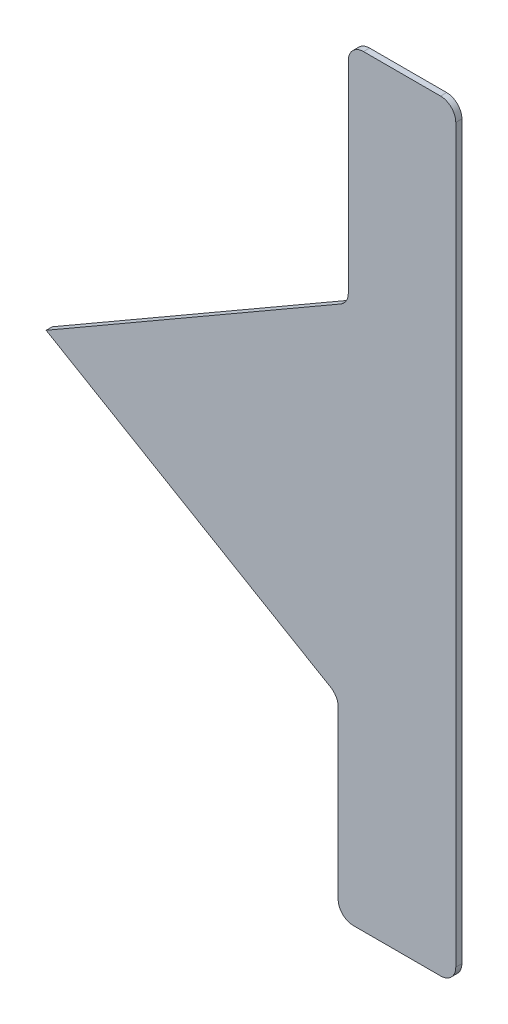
ISO-10303-21;
HEADER;
FILE_DESCRIPTION(('STEP AP214'),'2;1');
FILE_NAME('part.step','',(''),(''),'','','');
FILE_SCHEMA(('AUTOMOTIVE_DESIGN { 1 0 10303 214 1 1 1 1 }'));
ENDSEC;
DATA;
#1=APPLICATION_CONTEXT('core data for automotive mechanical design processes');
#2=APPLICATION_PROTOCOL_DEFINITION('international standard','automotive_design',2000,#1);
#3=PRODUCT_CONTEXT('',#1,'mechanical');
#4=PRODUCT('Part','Part','',(#3));
#5=PRODUCT_RELATED_PRODUCT_CATEGORY('part','',(#4));
#6=PRODUCT_DEFINITION_FORMATION('','',#4);
#7=PRODUCT_DEFINITION_CONTEXT('part definition',#1,'design');
#8=PRODUCT_DEFINITION('design','',#6,#7);
#9=PRODUCT_DEFINITION_SHAPE('','',#8);
#10=(LENGTH_UNIT() NAMED_UNIT(*) SI_UNIT(.MILLI.,.METRE.));
#11=(NAMED_UNIT(*) PLANE_ANGLE_UNIT() SI_UNIT($,.RADIAN.));
#12=(NAMED_UNIT(*) SI_UNIT($,.STERADIAN.) SOLID_ANGLE_UNIT());
#13=UNCERTAINTY_MEASURE_WITH_UNIT(LENGTH_MEASURE(1.E-05),#10,'distance_accuracy_value','');
#14=(GEOMETRIC_REPRESENTATION_CONTEXT(3) GLOBAL_UNCERTAINTY_ASSIGNED_CONTEXT((#13)) GLOBAL_UNIT_ASSIGNED_CONTEXT((#10,
#11,#12)) REPRESENTATION_CONTEXT('',''));
#15=CARTESIAN_POINT('',(0.,0.,0.));
#16=DIRECTION('',(0.,0.,1.));
#17=DIRECTION('',(1.,0.,0.));
#18=AXIS2_PLACEMENT_3D('',#15,#16,#17);
#19=CARTESIAN_POINT('',(0.,0.,-0.8));
#20=DIRECTION('',(0.,0.,1.));
#21=DIRECTION('',(1.,0.,0.));
#22=AXIS2_PLACEMENT_3D('',#19,#20,#21);
#23=PLANE('',#22);
#24=CARTESIAN_POINT('',(-2.79999999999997,2.,-0.8));
#25=DIRECTION('',(0.,0.,1.));
#26=DIRECTION('',(1.,0.,0.));
#27=AXIS2_PLACEMENT_3D('',#24,#25,#26);
#28=CIRCLE('',#27,2.);
#29=CARTESIAN_POINT('',(-2.79999999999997,0.,-0.8));
#30=VERTEX_POINT('',#29);
#31=CARTESIAN_POINT('',(-0.799999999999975,2.,-0.8));
#32=VERTEX_POINT('',#31);
#33=EDGE_CURVE('E20',#30,#32,#28,.T.);
#34=ORIENTED_EDGE('',*,*,#33,.F.);
#35=DIRECTION('',(1.,0.,0.));
#36=VECTOR('',#35,1.);
#37=CARTESIAN_POINT('',(-16.2342729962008,0.,-0.8));
#38=LINE('',#37,#36);
#39=CARTESIAN_POINT('',(-14.2342729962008,0.,-0.8));
#40=VERTEX_POINT('',#39);
#41=EDGE_CURVE('E117',#40,#30,#38,.T.);
#42=ORIENTED_EDGE('',*,*,#41,.F.);
#43=CARTESIAN_POINT('',(-14.2342729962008,2.,-0.8));
#44=DIRECTION('',(0.,0.,1.));
#45=DIRECTION('',(1.,0.,0.));
#46=AXIS2_PLACEMENT_3D('',#43,#44,#45);
#47=CIRCLE('',#46,2.);
#48=CARTESIAN_POINT('',(-16.2342729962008,2.,-0.8));
#49=VERTEX_POINT('',#48);
#50=EDGE_CURVE('E137',#49,#40,#47,.T.);
#51=ORIENTED_EDGE('',*,*,#50,.F.);
#52=DIRECTION('',(0.,1.,0.));
#53=VECTOR('',#52,1.);
#54=CARTESIAN_POINT('',(-16.2342729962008,25.0215926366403,-0.8));
#55=LINE('',#54,#53);
#56=CARTESIAN_POINT('',(-16.2342729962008,23.8760458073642,-0.8));
#57=VERTEX_POINT('',#56);
#58=EDGE_CURVE('E135',#57,#49,#55,.F.);
#59=ORIENTED_EDGE('',*,*,#58,.F.);
#60=CARTESIAN_POINT('',(-18.2342729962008,23.8760458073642,-0.8));
#61=DIRECTION('',(0.,0.,-1.));
#62=DIRECTION('',(-1.,0.,0.));
#63=AXIS2_PLACEMENT_3D('',#60,#61,#62);
#64=CIRCLE('',#63,2.);
#65=CARTESIAN_POINT('',(-17.2223821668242,25.6011768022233,-0.8));
#66=VERTEX_POINT('',#65);
#67=EDGE_CURVE('E181',#57,#66,#64,.F.);
#68=ORIENTED_EDGE('',*,*,#67,.T.);
#69=DIRECTION('',(0.862565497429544,-0.505945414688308,0.));
#70=VECTOR('',#69,1.);
#71=CARTESIAN_POINT('',(-16.2342729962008,25.0215926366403,-0.8));
#72=LINE('',#71,#70);
#73=CARTESIAN_POINT('',(-54.5567838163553,47.5,-0.8));
#74=VERTEX_POINT('',#73);
#75=EDGE_CURVE('E140',#74,#66,#72,.T.);
#76=ORIENTED_EDGE('',*,*,#75,.F.);
#77=DIRECTION('',(-0.866025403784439,-0.5,0.));
#78=VECTOR('',#77,1.);
#79=CARTESIAN_POINT('',(-54.5567838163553,47.5,-0.8));
#80=LINE('',#79,#78);
#81=CARTESIAN_POINT('',(-15.9031565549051,69.8166821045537,-0.8));
#82=VERTEX_POINT('',#81);
#83=EDGE_CURVE('E143',#82,#74,#80,.T.);
#84=ORIENTED_EDGE('',*,*,#83,.F.);
#85=CARTESIAN_POINT('',(-16.9031565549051,71.5487329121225,-0.8));
#86=DIRECTION('',(0.,0.,-1.));
#87=DIRECTION('',(-1.,0.,0.));
#88=AXIS2_PLACEMENT_3D('',#85,#86,#87);
#89=CIRCLE('',#88,2.);
#90=CARTESIAN_POINT('',(-14.9031565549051,71.5487329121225,-0.8));
#91=VERTEX_POINT('',#90);
#92=EDGE_CURVE('E185',#82,#91,#89,.F.);
#93=ORIENTED_EDGE('',*,*,#92,.T.);
#94=DIRECTION('',(0.,-1.,0.));
#95=VECTOR('',#94,1.);
#96=CARTESIAN_POINT('',(-14.9031565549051,100.,-0.8));
#97=LINE('',#96,#95);
#98=CARTESIAN_POINT('',(-14.9031565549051,98.,-0.8));
#99=VERTEX_POINT('',#98);
#100=EDGE_CURVE('E151',#99,#91,#97,.T.);
#101=ORIENTED_EDGE('',*,*,#100,.F.);
#102=CARTESIAN_POINT('',(-12.9031565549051,98.,-0.8));
#103=DIRECTION('',(0.,0.,1.));
#104=DIRECTION('',(1.,0.,0.));
#105=AXIS2_PLACEMENT_3D('',#102,#103,#104);
#106=CIRCLE('',#105,2.);
#107=CARTESIAN_POINT('',(-12.9031565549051,100.,-0.8));
#108=VERTEX_POINT('',#107);
#109=EDGE_CURVE('E189',#108,#99,#106,.T.);
#110=ORIENTED_EDGE('',*,*,#109,.F.);
#111=DIRECTION('',(1.,0.,0.));
#112=VECTOR('',#111,1.);
#113=CARTESIAN_POINT('',(-14.9031565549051,100.,-0.8));
#114=LINE('',#113,#112);
#115=CARTESIAN_POINT('',(-2.79999999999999,100.,-0.8));
#116=VERTEX_POINT('',#115);
#117=EDGE_CURVE('E155',#116,#108,#114,.F.);
#118=ORIENTED_EDGE('',*,*,#117,.F.);
#119=CARTESIAN_POINT('',(-2.79999999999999,98.,-0.8));
#120=DIRECTION('',(0.,0.,1.));
#121=DIRECTION('',(1.,0.,0.));
#122=AXIS2_PLACEMENT_3D('',#119,#120,#121);
#123=CIRCLE('',#122,2.);
#124=CARTESIAN_POINT('',(-0.799999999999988,98.,-0.8));
#125=VERTEX_POINT('',#124);
#126=EDGE_CURVE('E121',#125,#116,#123,.T.);
#127=ORIENTED_EDGE('',*,*,#126,.F.);
#128=DIRECTION('',(0.,1.,0.));
#129=VECTOR('',#128,1.);
#130=CARTESIAN_POINT('',(-0.799999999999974,0.,-0.8));
#131=LINE('',#130,#129);
#132=EDGE_CURVE('E119',#32,#125,#131,.T.);
#133=ORIENTED_EDGE('',*,*,#132,.F.);
#134=EDGE_LOOP('',(#34,#42,#51,#59,#68,#76,#84,#93,#101,#110,#118,#127,#133));
#135=FACE_BOUND('',#134,.T.);
#136=ADVANCED_FACE('F17',(#135),#23,.F.);
#137=CARTESIAN_POINT('',(-16.2342729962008,0.,-0.8));
#138=DIRECTION('',(0.,-1.,0.));
#139=DIRECTION('',(1.,0.,0.));
#140=AXIS2_PLACEMENT_3D('',#137,#138,#139);
#141=PLANE('',#140);
#142=DIRECTION('',(1.,0.,0.));
#143=VECTOR('',#142,1.);
#144=CARTESIAN_POINT('',(0.,0.,0.));
#145=LINE('',#144,#143);
#146=CARTESIAN_POINT('',(-14.2342729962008,0.,0.));
#147=VERTEX_POINT('',#146);
#148=CARTESIAN_POINT('',(-2.79999999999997,0.,0.));
#149=VERTEX_POINT('',#148);
#150=EDGE_CURVE('E177',#147,#149,#145,.T.);
#151=ORIENTED_EDGE('',*,*,#150,.F.);
#152=DIRECTION('',(0.,0.,1.));
#153=VECTOR('',#152,1.);
#154=CARTESIAN_POINT('',(-14.2342729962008,0.,-0.8));
#155=LINE('',#154,#153);
#156=EDGE_CURVE('E180',#40,#147,#155,.T.);
#157=ORIENTED_EDGE('',*,*,#156,.F.);
#158=ORIENTED_EDGE('',*,*,#41,.T.);
#159=DIRECTION('',(0.,0.,1.));
#160=VECTOR('',#159,1.);
#161=CARTESIAN_POINT('',(-2.79999999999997,0.,-0.8));
#162=LINE('',#161,#160);
#163=EDGE_CURVE('E116',#149,#30,#162,.F.);
#164=ORIENTED_EDGE('',*,*,#163,.F.);
#165=EDGE_LOOP('',(#151,#157,#158,#164));
#166=FACE_BOUND('',#165,.T.);
#167=ADVANCED_FACE('F253',(#166),#141,.T.);
#168=CARTESIAN_POINT('',(-2.79999999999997,2.,-0.8));
#169=DIRECTION('',(0.,0.,1.));
#170=DIRECTION('',(1.,0.,0.));
#171=AXIS2_PLACEMENT_3D('',#168,#169,#170);
#172=CYLINDRICAL_SURFACE('',#171,2.);
#173=CARTESIAN_POINT('',(-2.79999999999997,2.,0.));
#174=DIRECTION('',(0.,0.,1.));
#175=DIRECTION('',(1.,0.,0.));
#176=AXIS2_PLACEMENT_3D('',#173,#174,#175);
#177=CIRCLE('',#176,2.);
#178=CARTESIAN_POINT('',(-0.799999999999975,2.,0.));
#179=VERTEX_POINT('',#178);
#180=EDGE_CURVE('E175',#149,#179,#177,.T.);
#181=ORIENTED_EDGE('',*,*,#180,.F.);
#182=ORIENTED_EDGE('',*,*,#163,.T.);
#183=ORIENTED_EDGE('',*,*,#33,.T.);
#184=DIRECTION('',(0.,0.,1.));
#185=VECTOR('',#184,1.);
#186=CARTESIAN_POINT('',(-0.799999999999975,2.,-0.8));
#187=LINE('',#186,#185);
#188=EDGE_CURVE('E114',#179,#32,#187,.F.);
#189=ORIENTED_EDGE('',*,*,#188,.F.);
#190=EDGE_LOOP('',(#181,#182,#183,#189));
#191=FACE_BOUND('',#190,.T.);
#192=ADVANCED_FACE('F112',(#191),#172,.T.);
#193=CARTESIAN_POINT('',(-0.799999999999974,0.,-0.8));
#194=DIRECTION('',(1.,0.,0.));
#195=DIRECTION('',(0.,1.,0.));
#196=AXIS2_PLACEMENT_3D('',#193,#194,#195);
#197=PLANE('',#196);
#198=ORIENTED_EDGE('',*,*,#132,.T.);
#199=DIRECTION('',(0.,0.,1.));
#200=VECTOR('',#199,1.);
#201=CARTESIAN_POINT('',(-0.799999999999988,98.,-0.8));
#202=LINE('',#201,#200);
#203=CARTESIAN_POINT('',(-0.799999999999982,98.,0.));
#204=VERTEX_POINT('',#203);
#205=EDGE_CURVE('E132',#204,#125,#202,.F.);
#206=ORIENTED_EDGE('',*,*,#205,.F.);
#207=DIRECTION('',(0.,1.,0.));
#208=VECTOR('',#207,1.);
#209=CARTESIAN_POINT('',(-0.799999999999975,0.,0.));
#210=LINE('',#209,#208);
#211=EDGE_CURVE('E127',#179,#204,#210,.T.);
#212=ORIENTED_EDGE('',*,*,#211,.F.);
#213=ORIENTED_EDGE('',*,*,#188,.T.);
#214=EDGE_LOOP('',(#198,#206,#212,#213));
#215=FACE_BOUND('',#214,.T.);
#216=ADVANCED_FACE('F125',(#215),#197,.T.);
#217=CARTESIAN_POINT('',(-2.79999999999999,98.,-0.8));
#218=DIRECTION('',(0.,0.,1.));
#219=DIRECTION('',(1.,0.,0.));
#220=AXIS2_PLACEMENT_3D('',#217,#218,#219);
#221=CYLINDRICAL_SURFACE('',#220,2.);
#222=CARTESIAN_POINT('',(-2.79999999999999,98.,0.));
#223=DIRECTION('',(0.,0.,1.));
#224=DIRECTION('',(1.,0.,0.));
#225=AXIS2_PLACEMENT_3D('',#222,#223,#224);
#226=CIRCLE('',#225,2.);
#227=CARTESIAN_POINT('',(-2.79999999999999,100.,0.));
#228=VERTEX_POINT('',#227);
#229=EDGE_CURVE('E172',#204,#228,#226,.T.);
#230=ORIENTED_EDGE('',*,*,#229,.F.);
#231=ORIENTED_EDGE('',*,*,#205,.T.);
#232=ORIENTED_EDGE('',*,*,#126,.T.);
#233=DIRECTION('',(0.,0.,1.));
#234=VECTOR('',#233,1.);
#235=CARTESIAN_POINT('',(-2.79999999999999,100.,-0.8));
#236=LINE('',#235,#234);
#237=EDGE_CURVE('E157',#228,#116,#236,.F.);
#238=ORIENTED_EDGE('',*,*,#237,.F.);
#239=EDGE_LOOP('',(#230,#231,#232,#238));
#240=FACE_BOUND('',#239,.T.);
#241=ADVANCED_FACE('F194',(#240),#221,.T.);
#242=CARTESIAN_POINT('',(-14.9031565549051,100.,-0.8));
#243=DIRECTION('',(0.,1.,0.));
#244=DIRECTION('',(0.,0.,1.));
#245=AXIS2_PLACEMENT_3D('',#242,#243,#244);
#246=PLANE('',#245);
#247=DIRECTION('',(1.,0.,0.));
#248=VECTOR('',#247,1.);
#249=CARTESIAN_POINT('',(0.,100.,0.));
#250=LINE('',#249,#248);
#251=CARTESIAN_POINT('',(-12.9031565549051,100.,0.));
#252=VERTEX_POINT('',#251);
#253=EDGE_CURVE('E171',#228,#252,#250,.F.);
#254=ORIENTED_EDGE('',*,*,#253,.F.);
#255=ORIENTED_EDGE('',*,*,#237,.T.);
#256=ORIENTED_EDGE('',*,*,#117,.T.);
#257=DIRECTION('',(0.,0.,1.));
#258=VECTOR('',#257,1.);
#259=CARTESIAN_POINT('',(-12.9031565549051,100.,-0.8));
#260=LINE('',#259,#258);
#261=EDGE_CURVE('E154',#252,#108,#260,.F.);
#262=ORIENTED_EDGE('',*,*,#261,.F.);
#263=EDGE_LOOP('',(#254,#255,#256,#262));
#264=FACE_BOUND('',#263,.T.);
#265=ADVANCED_FACE('F223',(#264),#246,.T.);
#266=CARTESIAN_POINT('',(-12.9031565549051,98.,-0.8));
#267=DIRECTION('',(0.,0.,1.));
#268=DIRECTION('',(1.,0.,0.));
#269=AXIS2_PLACEMENT_3D('',#266,#267,#268);
#270=CYLINDRICAL_SURFACE('',#269,2.);
#271=CARTESIAN_POINT('',(-12.9031565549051,98.,0.));
#272=DIRECTION('',(0.,0.,1.));
#273=DIRECTION('',(1.,0.,0.));
#274=AXIS2_PLACEMENT_3D('',#271,#272,#273);
#275=CIRCLE('',#274,2.);
#276=CARTESIAN_POINT('',(-14.9031565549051,98.,0.));
#277=VERTEX_POINT('',#276);
#278=EDGE_CURVE('E168',#252,#277,#275,.T.);
#279=ORIENTED_EDGE('',*,*,#278,.F.);
#280=ORIENTED_EDGE('',*,*,#261,.T.);
#281=ORIENTED_EDGE('',*,*,#109,.T.);
#282=DIRECTION('',(0.,0.,1.));
#283=VECTOR('',#282,1.);
#284=CARTESIAN_POINT('',(-14.9031565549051,98.,-0.8));
#285=LINE('',#284,#283);
#286=EDGE_CURVE('E153',#277,#99,#285,.F.);
#287=ORIENTED_EDGE('',*,*,#286,.F.);
#288=EDGE_LOOP('',(#279,#280,#281,#287));
#289=FACE_BOUND('',#288,.T.);
#290=ADVANCED_FACE('F228',(#289),#270,.T.);
#291=CARTESIAN_POINT('',(-14.9031565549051,100.,-0.8));
#292=DIRECTION('',(-1.,0.,0.));
#293=DIRECTION('',(0.,-1.,0.));
#294=AXIS2_PLACEMENT_3D('',#291,#292,#293);
#295=PLANE('',#294);
#296=DIRECTION('',(0.,1.,0.));
#297=VECTOR('',#296,1.);
#298=CARTESIAN_POINT('',(-14.9031565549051,0.,0.));
#299=LINE('',#298,#297);
#300=CARTESIAN_POINT('',(-14.9031565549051,71.5487329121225,0.));
#301=VERTEX_POINT('',#300);
#302=EDGE_CURVE('E167',#277,#301,#299,.F.);
#303=ORIENTED_EDGE('',*,*,#302,.F.);
#304=ORIENTED_EDGE('',*,*,#286,.T.);
#305=ORIENTED_EDGE('',*,*,#100,.T.);
#306=DIRECTION('',(0.,0.,-1.));
#307=VECTOR('',#306,1.);
#308=CARTESIAN_POINT('',(-14.9031565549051,71.5487329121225,-0.8));
#309=LINE('',#308,#307);
#310=EDGE_CURVE('E188',#91,#301,#309,.F.);
#311=ORIENTED_EDGE('',*,*,#310,.T.);
#312=EDGE_LOOP('',(#303,#304,#305,#311));
#313=FACE_BOUND('',#312,.T.);
#314=ADVANCED_FACE('F230',(#313),#295,.T.);
#315=CARTESIAN_POINT('',(-16.9031565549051,71.5487329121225,-0.8));
#316=DIRECTION('',(0.,0.,-1.));
#317=DIRECTION('',(-1.,0.,0.));
#318=AXIS2_PLACEMENT_3D('',#315,#316,#317);
#319=CYLINDRICAL_SURFACE('',#318,2.);
#320=DIRECTION('',(0.,0.,1.));
#321=VECTOR('',#320,1.);
#322=CARTESIAN_POINT('',(-15.9031565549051,69.8166821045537,-0.8));
#323=LINE('',#322,#321);
#324=CARTESIAN_POINT('',(-15.9031565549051,69.8166821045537,0.));
#325=VERTEX_POINT('',#324);
#326=EDGE_CURVE('E148',#325,#82,#323,.F.);
#327=ORIENTED_EDGE('',*,*,#326,.F.);
#328=CARTESIAN_POINT('',(-16.9031565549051,71.5487329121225,0.));
#329=DIRECTION('',(0.,0.,-1.));
#330=DIRECTION('',(-1.,0.,0.));
#331=AXIS2_PLACEMENT_3D('',#328,#329,#330);
#332=CIRCLE('',#331,2.);
#333=EDGE_CURVE('E163',#301,#325,#332,.T.);
#334=ORIENTED_EDGE('',*,*,#333,.F.);
#335=ORIENTED_EDGE('',*,*,#310,.F.);
#336=ORIENTED_EDGE('',*,*,#92,.F.);
#337=EDGE_LOOP('',(#327,#334,#335,#336));
#338=FACE_BOUND('',#337,.T.);
#339=ADVANCED_FACE('F279',(#338),#319,.F.);
#340=CARTESIAN_POINT('',(-54.5567838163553,47.5,-0.8));
#341=DIRECTION('',(-0.5,0.866025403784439,0.));
#342=DIRECTION('',(-0.866025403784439,-0.5,0.));
#343=AXIS2_PLACEMENT_3D('',#340,#341,#342);
#344=PLANE('',#343);
#345=ORIENTED_EDGE('',*,*,#83,.T.);
#346=DIRECTION('',(0.,0.,1.));
#347=VECTOR('',#346,1.);
#348=CARTESIAN_POINT('',(-54.5567838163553,47.5,-0.8));
#349=LINE('',#348,#347);
#350=CARTESIAN_POINT('',(-54.5567838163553,47.5,0.));
#351=VERTEX_POINT('',#350);
#352=EDGE_CURVE('E142',#351,#74,#349,.F.);
#353=ORIENTED_EDGE('',*,*,#352,.F.);
#354=DIRECTION('',(-0.866025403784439,-0.5,0.));
#355=VECTOR('',#354,1.);
#356=CARTESIAN_POINT('',(-15.9031565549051,69.8166821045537,0.));
#357=LINE('',#356,#355);
#358=EDGE_CURVE('E166',#325,#351,#357,.T.);
#359=ORIENTED_EDGE('',*,*,#358,.F.);
#360=ORIENTED_EDGE('',*,*,#326,.T.);
#361=EDGE_LOOP('',(#345,#353,#359,#360));
#362=FACE_BOUND('',#361,.T.);
#363=ADVANCED_FACE('F275',(#362),#344,.T.);
#364=CARTESIAN_POINT('',(-16.2342729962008,25.0215926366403,-0.8));
#365=DIRECTION('',(-0.505945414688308,-0.862565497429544,0.));
#366=DIRECTION('',(0.862565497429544,-0.505945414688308,0.));
#367=AXIS2_PLACEMENT_3D('',#364,#365,#366);
#368=PLANE('',#367);
#369=DIRECTION('',(0.862565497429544,-0.505945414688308,0.));
#370=VECTOR('',#369,1.);
#371=CARTESIAN_POINT('',(-54.5567838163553,47.5,0.));
#372=LINE('',#371,#370);
#373=CARTESIAN_POINT('',(-17.2223821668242,25.6011768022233,0.));
#374=VERTEX_POINT('',#373);
#375=EDGE_CURVE('E162',#351,#374,#372,.T.);
#376=ORIENTED_EDGE('',*,*,#375,.F.);
#377=ORIENTED_EDGE('',*,*,#352,.T.);
#378=ORIENTED_EDGE('',*,*,#75,.T.);
#379=DIRECTION('',(0.,0.,-1.));
#380=VECTOR('',#379,1.);
#381=CARTESIAN_POINT('',(-17.2223821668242,25.6011768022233,-0.8));
#382=LINE('',#381,#380);
#383=EDGE_CURVE('E184',#66,#374,#382,.F.);
#384=ORIENTED_EDGE('',*,*,#383,.T.);
#385=EDGE_LOOP('',(#376,#377,#378,#384));
#386=FACE_BOUND('',#385,.T.);
#387=ADVANCED_FACE('F272',(#386),#368,.T.);
#388=CARTESIAN_POINT('',(-18.2342729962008,23.8760458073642,-0.8));
#389=DIRECTION('',(0.,0.,-1.));
#390=DIRECTION('',(-1.,0.,0.));
#391=AXIS2_PLACEMENT_3D('',#388,#389,#390);
#392=CYLINDRICAL_SURFACE('',#391,2.);
#393=DIRECTION('',(0.,0.,1.));
#394=VECTOR('',#393,1.);
#395=CARTESIAN_POINT('',(-16.2342729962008,23.8760458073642,-0.8));
#396=LINE('',#395,#394);
#397=CARTESIAN_POINT('',(-16.2342729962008,23.8760458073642,0.));
#398=VERTEX_POINT('',#397);
#399=EDGE_CURVE('E138',#398,#57,#396,.F.);
#400=ORIENTED_EDGE('',*,*,#399,.F.);
#401=CARTESIAN_POINT('',(-18.2342729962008,23.8760458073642,0.));
#402=DIRECTION('',(0.,0.,-1.));
#403=DIRECTION('',(-1.,0.,0.));
#404=AXIS2_PLACEMENT_3D('',#401,#402,#403);
#405=CIRCLE('',#404,2.);
#406=EDGE_CURVE('E159',#374,#398,#405,.T.);
#407=ORIENTED_EDGE('',*,*,#406,.F.);
#408=ORIENTED_EDGE('',*,*,#383,.F.);
#409=ORIENTED_EDGE('',*,*,#67,.F.);
#410=EDGE_LOOP('',(#400,#407,#408,#409));
#411=FACE_BOUND('',#410,.T.);
#412=ADVANCED_FACE('F246',(#411),#392,.F.);
#413=CARTESIAN_POINT('',(-16.2342729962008,25.0215926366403,-0.8));
#414=DIRECTION('',(-1.,0.,0.));
#415=DIRECTION('',(0.,0.,1.));
#416=AXIS2_PLACEMENT_3D('',#413,#414,#415);
#417=PLANE('',#416);
#418=ORIENTED_EDGE('',*,*,#58,.T.);
#419=DIRECTION('',(0.,0.,1.));
#420=VECTOR('',#419,1.);
#421=CARTESIAN_POINT('',(-16.2342729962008,2.00000000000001,-0.8));
#422=LINE('',#421,#420);
#423=CARTESIAN_POINT('',(-16.2342729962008,2.,0.));
#424=VERTEX_POINT('',#423);
#425=EDGE_CURVE('E35',#424,#49,#422,.F.);
#426=ORIENTED_EDGE('',*,*,#425,.F.);
#427=DIRECTION('',(0.,1.,0.));
#428=VECTOR('',#427,1.);
#429=CARTESIAN_POINT('',(-16.2342729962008,0.,0.));
#430=LINE('',#429,#428);
#431=EDGE_CURVE('E26',#398,#424,#430,.F.);
#432=ORIENTED_EDGE('',*,*,#431,.F.);
#433=ORIENTED_EDGE('',*,*,#399,.T.);
#434=EDGE_LOOP('',(#418,#426,#432,#433));
#435=FACE_BOUND('',#434,.T.);
#436=ADVANCED_FACE('F243',(#435),#417,.T.);
#437=CARTESIAN_POINT('',(-14.2342729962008,2.,-0.8));
#438=DIRECTION('',(0.,0.,1.));
#439=DIRECTION('',(1.,0.,0.));
#440=AXIS2_PLACEMENT_3D('',#437,#438,#439);
#441=CYLINDRICAL_SURFACE('',#440,2.);
#442=CARTESIAN_POINT('',(-14.2342729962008,2.,0.));
#443=DIRECTION('',(0.,0.,1.));
#444=DIRECTION('',(1.,0.,0.));
#445=AXIS2_PLACEMENT_3D('',#442,#443,#444);
#446=CIRCLE('',#445,2.);
#447=EDGE_CURVE('E11',#424,#147,#446,.T.);
#448=ORIENTED_EDGE('',*,*,#447,.F.);
#449=ORIENTED_EDGE('',*,*,#425,.T.);
#450=ORIENTED_EDGE('',*,*,#50,.T.);
#451=ORIENTED_EDGE('',*,*,#156,.T.);
#452=EDGE_LOOP('',(#448,#449,#450,#451));
#453=FACE_BOUND('',#452,.T.);
#454=ADVANCED_FACE('F251',(#453),#441,.T.);
#455=CARTESIAN_POINT('',(0.,0.,0.));
#456=DIRECTION('',(0.,0.,1.));
#457=DIRECTION('',(1.,0.,0.));
#458=AXIS2_PLACEMENT_3D('',#455,#456,#457);
#459=PLANE('',#458);
#460=ORIENTED_EDGE('',*,*,#431,.T.);
#461=ORIENTED_EDGE('',*,*,#447,.T.);
#462=ORIENTED_EDGE('',*,*,#150,.T.);
#463=ORIENTED_EDGE('',*,*,#180,.T.);
#464=ORIENTED_EDGE('',*,*,#211,.T.);
#465=ORIENTED_EDGE('',*,*,#229,.T.);
#466=ORIENTED_EDGE('',*,*,#253,.T.);
#467=ORIENTED_EDGE('',*,*,#278,.T.);
#468=ORIENTED_EDGE('',*,*,#302,.T.);
#469=ORIENTED_EDGE('',*,*,#333,.T.);
#470=ORIENTED_EDGE('',*,*,#358,.T.);
#471=ORIENTED_EDGE('',*,*,#375,.T.);
#472=ORIENTED_EDGE('',*,*,#406,.T.);
#473=EDGE_LOOP('',(#460,#461,#462,#463,#464,#465,#466,#467,#468,#469,#470,#471,#472));
#474=FACE_BOUND('',#473,.T.);
#475=ADVANCED_FACE('F199',(#474),#459,.T.);
#476=CLOSED_SHELL('',(#136,#167,#192,#216,#241,#265,#290,#314,#339,#363,#387,#412,#436,#454,#475));
#477=MANIFOLD_SOLID_BREP('B1',#476);
#478=ADVANCED_BREP_SHAPE_REPRESENTATION('',(#18,#477),#14);
#479=SHAPE_DEFINITION_REPRESENTATION(#9,#478);
ENDSEC;
END-ISO-10303-21;
